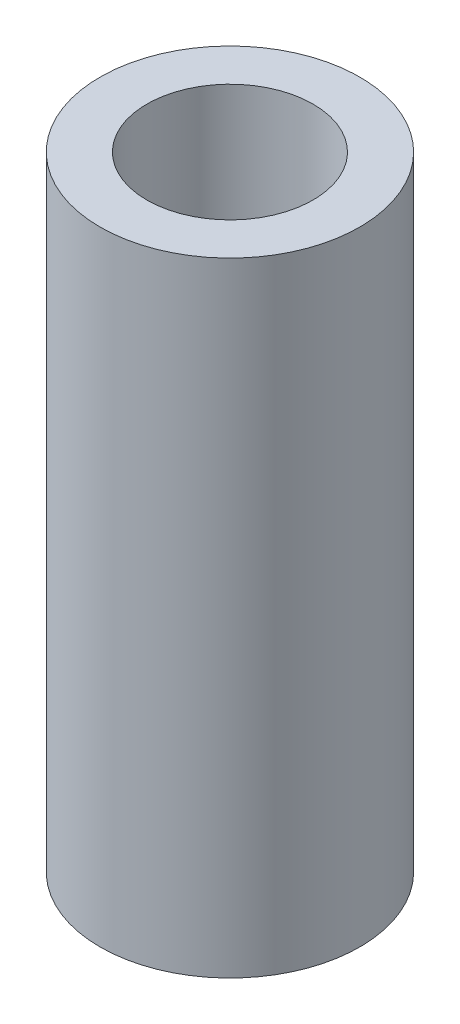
from build123d import *

# Parameters (mm, degrees)
SKETCH1_R                  = 2.5
BOSS_EXTRUDE1_DEPTH        = 12
F_3_2_3_2_DIAMETER_HOLE1_D = 3.2


with BuildPart() as part:
    # Sketch1 → Boss-Extrude1 (new body)
    with BuildSketch(Plane(origin=(0, 0, 0), x_dir=(1, 0, 0), z_dir=(0, 1, 0))):
        with Locations(Location((0, 0, 0), (0, 0, 270))):
            Circle(SKETCH1_R)
    extrude(amount=BOSS_EXTRUDE1_DEPTH)

    # 3.2 _3.2_ Diameter Hole1 (through all)
    with Locations(Plane(origin=(0, 12, 0), x_dir=(-1, 0, 0), z_dir=(0, 1, 0))):
        with Locations((0, 0)):
            Hole(F_3_2_3_2_DIAMETER_HOLE1_D / 2)


solid = part.part
